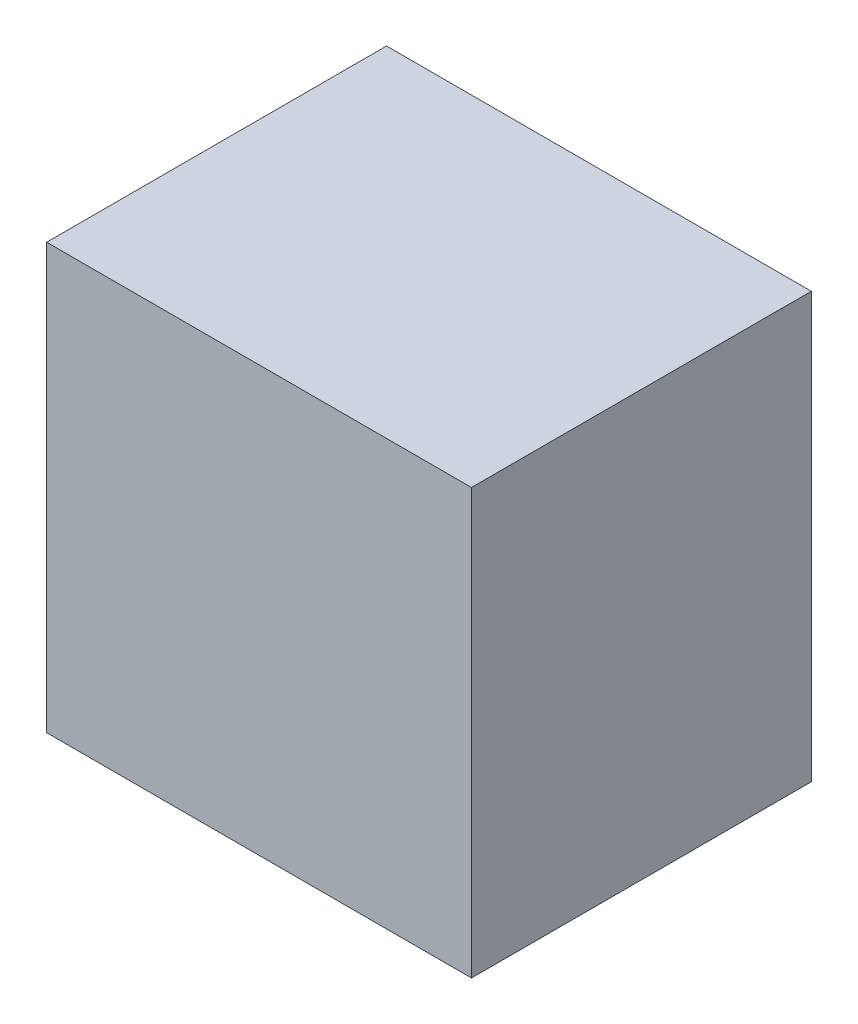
ISO-10303-21;
HEADER;
FILE_DESCRIPTION(('STEP AP214'),'2;1');
FILE_NAME('part.step','',(''),(''),'','','');
FILE_SCHEMA(('AUTOMOTIVE_DESIGN { 1 0 10303 214 1 1 1 1 }'));
ENDSEC;
DATA;
#1=APPLICATION_CONTEXT('core data for automotive mechanical design processes');
#2=APPLICATION_PROTOCOL_DEFINITION('international standard','automotive_design',2000,#1);
#3=PRODUCT_CONTEXT('',#1,'mechanical');
#4=PRODUCT('Part','Part','',(#3));
#5=PRODUCT_RELATED_PRODUCT_CATEGORY('part','',(#4));
#6=PRODUCT_DEFINITION_FORMATION('','',#4);
#7=PRODUCT_DEFINITION_CONTEXT('part definition',#1,'design');
#8=PRODUCT_DEFINITION('design','',#6,#7);
#9=PRODUCT_DEFINITION_SHAPE('','',#8);
#10=(LENGTH_UNIT() NAMED_UNIT(*) SI_UNIT(.MILLI.,.METRE.));
#11=(NAMED_UNIT(*) PLANE_ANGLE_UNIT() SI_UNIT($,.RADIAN.));
#12=(NAMED_UNIT(*) SI_UNIT($,.STERADIAN.) SOLID_ANGLE_UNIT());
#13=UNCERTAINTY_MEASURE_WITH_UNIT(LENGTH_MEASURE(1.E-05),#10,'distance_accuracy_value','');
#14=(GEOMETRIC_REPRESENTATION_CONTEXT(3) GLOBAL_UNCERTAINTY_ASSIGNED_CONTEXT((#13)) GLOBAL_UNIT_ASSIGNED_CONTEXT((#10,
#11,#12)) REPRESENTATION_CONTEXT('',''));
#15=CARTESIAN_POINT('',(0.,0.,0.));
#16=DIRECTION('',(0.,0.,1.));
#17=DIRECTION('',(1.,0.,0.));
#18=AXIS2_PLACEMENT_3D('',#15,#16,#17);
#19=CARTESIAN_POINT('',(0.,20.7846096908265,10.));
#20=DIRECTION('',(0.,0.,1.));
#21=DIRECTION('',(1.,0.,0.));
#22=AXIS2_PLACEMENT_3D('',#19,#20,#21);
#23=PLANE('',#22);
#24=DIRECTION('',(-0.866025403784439,0.5,0.));
#25=VECTOR('',#24,1.);
#26=CARTESIAN_POINT('',(8.49999999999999,4.90747728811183,10.));
#27=LINE('',#26,#25);
#28=CARTESIAN_POINT('',(8.49999999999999,4.90747728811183,10.));
#29=VERTEX_POINT('',#28);
#30=CARTESIAN_POINT('',(0.,9.81495457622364,10.));
#31=VERTEX_POINT('',#30);
#32=EDGE_CURVE('E171',#29,#31,#27,.T.);
#33=ORIENTED_EDGE('',*,*,#32,.T.);
#34=DIRECTION('',(-0.866025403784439,-0.5,0.));
#35=VECTOR('',#34,1.);
#36=CARTESIAN_POINT('',(0.,9.81495457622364,10.));
#37=LINE('',#36,#35);
#38=CARTESIAN_POINT('',(-8.5,4.90747728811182,10.));
#39=VERTEX_POINT('',#38);
#40=EDGE_CURVE('E168',#31,#39,#37,.T.);
#41=ORIENTED_EDGE('',*,*,#40,.T.);
#42=DIRECTION('',(0.,-1.,0.));
#43=VECTOR('',#42,1.);
#44=CARTESIAN_POINT('',(-8.5,4.90747728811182,10.));
#45=LINE('',#44,#43);
#46=CARTESIAN_POINT('',(-8.5,-4.90747728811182,10.));
#47=VERTEX_POINT('',#46);
#48=EDGE_CURVE('E165',#39,#47,#45,.T.);
#49=ORIENTED_EDGE('',*,*,#48,.T.);
#50=DIRECTION('',(0.866025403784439,-0.5,0.));
#51=VECTOR('',#50,1.);
#52=CARTESIAN_POINT('',(-8.5,-4.90747728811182,10.));
#53=LINE('',#52,#51);
#54=CARTESIAN_POINT('',(0.,-9.81495457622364,10.));
#55=VERTEX_POINT('',#54);
#56=EDGE_CURVE('E162',#47,#55,#53,.T.);
#57=ORIENTED_EDGE('',*,*,#56,.T.);
#58=DIRECTION('',(0.866025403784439,0.5,0.));
#59=VECTOR('',#58,1.);
#60=CARTESIAN_POINT('',(0.,-9.81495457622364,10.));
#61=LINE('',#60,#59);
#62=CARTESIAN_POINT('',(8.49999999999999,-4.90747728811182,10.));
#63=VERTEX_POINT('',#62);
#64=EDGE_CURVE('E159',#55,#63,#61,.T.);
#65=ORIENTED_EDGE('',*,*,#64,.T.);
#66=DIRECTION('',(0.,1.,0.));
#67=VECTOR('',#66,1.);
#68=CARTESIAN_POINT('',(8.49999999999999,-4.90747728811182,10.));
#69=LINE('',#68,#67);
#70=EDGE_CURVE('E156',#63,#29,#69,.T.);
#71=ORIENTED_EDGE('',*,*,#70,.T.);
#72=EDGE_LOOP('',(#33,#41,#49,#57,#65,#71));
#73=FACE_BOUND('',#72,.T.);
#74=DIRECTION('',(1.,0.,0.));
#75=VECTOR('',#74,1.);
#76=CARTESIAN_POINT('',(-25.,25.,10.));
#77=LINE('',#76,#75);
#78=CARTESIAN_POINT('',(-25.,25.,10.));
#79=VERTEX_POINT('',#78);
#80=CARTESIAN_POINT('',(25.,25.,10.));
#81=VERTEX_POINT('',#80);
#82=EDGE_CURVE('E114',#79,#81,#77,.T.);
#83=ORIENTED_EDGE('',*,*,#82,.T.);
#84=DIRECTION('',(0.,-1.,0.));
#85=VECTOR('',#84,1.);
#86=CARTESIAN_POINT('',(25.,25.,10.));
#87=LINE('',#86,#85);
#88=CARTESIAN_POINT('',(25.,-25.,10.));
#89=VERTEX_POINT('',#88);
#90=EDGE_CURVE('E51',#81,#89,#87,.T.);
#91=ORIENTED_EDGE('',*,*,#90,.T.);
#92=DIRECTION('',(-1.,0.,0.));
#93=VECTOR('',#92,1.);
#94=CARTESIAN_POINT('',(25.,-25.,10.));
#95=LINE('',#94,#93);
#96=CARTESIAN_POINT('',(-25.,-25.,10.));
#97=VERTEX_POINT('',#96);
#98=EDGE_CURVE('E115',#89,#97,#95,.T.);
#99=ORIENTED_EDGE('',*,*,#98,.T.);
#100=DIRECTION('',(0.,1.,0.));
#101=VECTOR('',#100,1.);
#102=CARTESIAN_POINT('',(-25.,-25.,10.));
#103=LINE('',#102,#101);
#104=EDGE_CURVE('E112',#97,#79,#103,.T.);
#105=ORIENTED_EDGE('',*,*,#104,.T.);
#106=EDGE_LOOP('',(#83,#91,#99,#105));
#107=FACE_BOUND('',#106,.T.);
#108=ADVANCED_FACE('F36',(#73,#107),#23,.F.);
#109=CARTESIAN_POINT('',(8.49999999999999,4.90747728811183,0.));
#110=DIRECTION('',(0.5,0.866025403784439,0.));
#111=DIRECTION('',(-0.866025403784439,0.5,0.));
#112=AXIS2_PLACEMENT_3D('',#109,#110,#111);
#113=PLANE('',#112);
#114=ORIENTED_EDGE('',*,*,#32,.F.);
#115=DIRECTION('',(0.,0.,1.));
#116=VECTOR('',#115,1.);
#117=CARTESIAN_POINT('',(8.49999999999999,4.90747728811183,0.));
#118=LINE('',#117,#116);
#119=CARTESIAN_POINT('',(8.49999999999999,4.90747728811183,0.));
#120=VERTEX_POINT('',#119);
#121=EDGE_CURVE('E143',#120,#29,#118,.T.);
#122=ORIENTED_EDGE('',*,*,#121,.F.);
#123=DIRECTION('',(-0.866025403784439,0.5,0.));
#124=VECTOR('',#123,1.);
#125=CARTESIAN_POINT('',(8.49999999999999,4.90747728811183,0.));
#126=LINE('',#125,#124);
#127=CARTESIAN_POINT('',(0.,9.81495457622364,0.));
#128=VERTEX_POINT('',#127);
#129=EDGE_CURVE('E59',#120,#128,#126,.T.);
#130=ORIENTED_EDGE('',*,*,#129,.T.);
#131=DIRECTION('',(0.,0.,1.));
#132=VECTOR('',#131,1.);
#133=CARTESIAN_POINT('',(0.,9.81495457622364,0.));
#134=LINE('',#133,#132);
#135=EDGE_CURVE('E144',#128,#31,#134,.T.);
#136=ORIENTED_EDGE('',*,*,#135,.T.);
#137=EDGE_LOOP('',(#114,#122,#130,#136));
#138=FACE_BOUND('',#137,.T.);
#139=ADVANCED_FACE('F213',(#138),#113,.T.);
#140=CARTESIAN_POINT('',(8.49999999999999,-4.90747728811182,0.));
#141=DIRECTION('',(1.,0.,0.));
#142=DIRECTION('',(0.,1.,0.));
#143=AXIS2_PLACEMENT_3D('',#140,#141,#142);
#144=PLANE('',#143);
#145=ORIENTED_EDGE('',*,*,#70,.F.);
#146=DIRECTION('',(0.,0.,1.));
#147=VECTOR('',#146,1.);
#148=CARTESIAN_POINT('',(8.49999999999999,-4.90747728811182,0.));
#149=LINE('',#148,#147);
#150=CARTESIAN_POINT('',(8.49999999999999,-4.90747728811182,0.));
#151=VERTEX_POINT('',#150);
#152=EDGE_CURVE('E153',#151,#63,#149,.T.);
#153=ORIENTED_EDGE('',*,*,#152,.F.);
#154=DIRECTION('',(0.,1.,0.));
#155=VECTOR('',#154,1.);
#156=CARTESIAN_POINT('',(8.49999999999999,-4.90747728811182,0.));
#157=LINE('',#156,#155);
#158=EDGE_CURVE('E147',#151,#120,#157,.T.);
#159=ORIENTED_EDGE('',*,*,#158,.T.);
#160=ORIENTED_EDGE('',*,*,#121,.T.);
#161=EDGE_LOOP('',(#145,#153,#159,#160));
#162=FACE_BOUND('',#161,.T.);
#163=ADVANCED_FACE('F212',(#162),#144,.T.);
#164=CARTESIAN_POINT('',(0.,-9.81495457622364,0.));
#165=DIRECTION('',(0.5,-0.866025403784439,0.));
#166=DIRECTION('',(0.866025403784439,0.5,0.));
#167=AXIS2_PLACEMENT_3D('',#164,#165,#166);
#168=PLANE('',#167);
#169=ORIENTED_EDGE('',*,*,#64,.F.);
#170=DIRECTION('',(0.,0.,1.));
#171=VECTOR('',#170,1.);
#172=CARTESIAN_POINT('',(0.,-9.81495457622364,0.));
#173=LINE('',#172,#171);
#174=CARTESIAN_POINT('',(0.,-9.81495457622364,0.));
#175=VERTEX_POINT('',#174);
#176=EDGE_CURVE('E151',#175,#55,#173,.T.);
#177=ORIENTED_EDGE('',*,*,#176,.F.);
#178=DIRECTION('',(0.866025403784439,0.5,0.));
#179=VECTOR('',#178,1.);
#180=CARTESIAN_POINT('',(0.,-9.81495457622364,0.));
#181=LINE('',#180,#179);
#182=EDGE_CURVE('E175',#175,#151,#181,.T.);
#183=ORIENTED_EDGE('',*,*,#182,.T.);
#184=ORIENTED_EDGE('',*,*,#152,.T.);
#185=EDGE_LOOP('',(#169,#177,#183,#184));
#186=FACE_BOUND('',#185,.T.);
#187=ADVANCED_FACE('F207',(#186),#168,.T.);
#188=CARTESIAN_POINT('',(-8.5,-4.90747728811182,0.));
#189=DIRECTION('',(-0.5,-0.866025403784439,0.));
#190=DIRECTION('',(0.866025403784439,-0.5,0.));
#191=AXIS2_PLACEMENT_3D('',#188,#189,#190);
#192=PLANE('',#191);
#193=ORIENTED_EDGE('',*,*,#56,.F.);
#194=DIRECTION('',(0.,0.,1.));
#195=VECTOR('',#194,1.);
#196=CARTESIAN_POINT('',(-8.5,-4.90747728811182,0.));
#197=LINE('',#196,#195);
#198=CARTESIAN_POINT('',(-8.5,-4.90747728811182,0.));
#199=VERTEX_POINT('',#198);
#200=EDGE_CURVE('E149',#199,#47,#197,.T.);
#201=ORIENTED_EDGE('',*,*,#200,.F.);
#202=DIRECTION('',(0.866025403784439,-0.5,0.));
#203=VECTOR('',#202,1.);
#204=CARTESIAN_POINT('',(-8.5,-4.90747728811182,0.));
#205=LINE('',#204,#203);
#206=EDGE_CURVE('E178',#199,#175,#205,.T.);
#207=ORIENTED_EDGE('',*,*,#206,.T.);
#208=ORIENTED_EDGE('',*,*,#176,.T.);
#209=EDGE_LOOP('',(#193,#201,#207,#208));
#210=FACE_BOUND('',#209,.T.);
#211=ADVANCED_FACE('F205',(#210),#192,.T.);
#212=CARTESIAN_POINT('',(-8.5,4.90747728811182,0.));
#213=DIRECTION('',(-1.,0.,0.));
#214=DIRECTION('',(0.,-1.,0.));
#215=AXIS2_PLACEMENT_3D('',#212,#213,#214);
#216=PLANE('',#215);
#217=ORIENTED_EDGE('',*,*,#48,.F.);
#218=DIRECTION('',(0.,0.,1.));
#219=VECTOR('',#218,1.);
#220=CARTESIAN_POINT('',(-8.5,4.90747728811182,0.));
#221=LINE('',#220,#219);
#222=CARTESIAN_POINT('',(-8.5,4.90747728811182,0.));
#223=VERTEX_POINT('',#222);
#224=EDGE_CURVE('E146',#223,#39,#221,.T.);
#225=ORIENTED_EDGE('',*,*,#224,.F.);
#226=DIRECTION('',(0.,-1.,0.));
#227=VECTOR('',#226,1.);
#228=CARTESIAN_POINT('',(-8.5,4.90747728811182,0.));
#229=LINE('',#228,#227);
#230=EDGE_CURVE('E181',#223,#199,#229,.T.);
#231=ORIENTED_EDGE('',*,*,#230,.T.);
#232=ORIENTED_EDGE('',*,*,#200,.T.);
#233=EDGE_LOOP('',(#217,#225,#231,#232));
#234=FACE_BOUND('',#233,.T.);
#235=ADVANCED_FACE('F200',(#234),#216,.T.);
#236=CARTESIAN_POINT('',(0.,9.81495457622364,0.));
#237=DIRECTION('',(-0.5,0.866025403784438,0.));
#238=DIRECTION('',(-0.866025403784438,-0.5,0.));
#239=AXIS2_PLACEMENT_3D('',#236,#237,#238);
#240=PLANE('',#239);
#241=ORIENTED_EDGE('',*,*,#40,.F.);
#242=ORIENTED_EDGE('',*,*,#135,.F.);
#243=DIRECTION('',(-0.866025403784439,-0.5,0.));
#244=VECTOR('',#243,1.);
#245=CARTESIAN_POINT('',(0.,9.81495457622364,0.));
#246=LINE('',#245,#244);
#247=EDGE_CURVE('E184',#128,#223,#246,.T.);
#248=ORIENTED_EDGE('',*,*,#247,.T.);
#249=ORIENTED_EDGE('',*,*,#224,.T.);
#250=EDGE_LOOP('',(#241,#242,#248,#249));
#251=FACE_BOUND('',#250,.T.);
#252=ADVANCED_FACE('F193',(#251),#240,.T.);
#253=CARTESIAN_POINT('',(25.,25.,0.));
#254=DIRECTION('',(0.,0.,-1.));
#255=DIRECTION('',(-1.,0.,0.));
#256=AXIS2_PLACEMENT_3D('',#253,#254,#255);
#257=PLANE('',#256);
#258=ORIENTED_EDGE('',*,*,#247,.F.);
#259=ORIENTED_EDGE('',*,*,#129,.F.);
#260=ORIENTED_EDGE('',*,*,#158,.F.);
#261=ORIENTED_EDGE('',*,*,#182,.F.);
#262=ORIENTED_EDGE('',*,*,#206,.F.);
#263=ORIENTED_EDGE('',*,*,#230,.F.);
#264=EDGE_LOOP('',(#258,#259,#260,#261,#262,#263));
#265=FACE_BOUND('',#264,.T.);
#266=ADVANCED_FACE('F196',(#265),#257,.T.);
#267=CARTESIAN_POINT('',(25.,25.,50.));
#268=DIRECTION('',(0.,0.,-1.));
#269=DIRECTION('',(-1.,0.,0.));
#270=AXIS2_PLACEMENT_3D('',#267,#268,#269);
#271=PLANE('',#270);
#272=DIRECTION('',(0.,1.,0.));
#273=VECTOR('',#272,1.);
#274=CARTESIAN_POINT('',(25.,-25.,50.));
#275=LINE('',#274,#273);
#276=CARTESIAN_POINT('',(25.,-25.,50.));
#277=VERTEX_POINT('',#276);
#278=CARTESIAN_POINT('',(25.,25.,50.));
#279=VERTEX_POINT('',#278);
#280=EDGE_CURVE('E140',#277,#279,#275,.T.);
#281=ORIENTED_EDGE('',*,*,#280,.T.);
#282=DIRECTION('',(-1.,0.,0.));
#283=VECTOR('',#282,1.);
#284=CARTESIAN_POINT('',(-25.,25.,50.));
#285=LINE('',#284,#283);
#286=CARTESIAN_POINT('',(-25.,25.,50.));
#287=VERTEX_POINT('',#286);
#288=EDGE_CURVE('E138',#279,#287,#285,.T.);
#289=ORIENTED_EDGE('',*,*,#288,.T.);
#290=DIRECTION('',(0.,-1.,0.));
#291=VECTOR('',#290,1.);
#292=CARTESIAN_POINT('',(-25.,-25.,50.));
#293=LINE('',#292,#291);
#294=CARTESIAN_POINT('',(-25.,-25.,50.));
#295=VERTEX_POINT('',#294);
#296=EDGE_CURVE('E128',#287,#295,#293,.T.);
#297=ORIENTED_EDGE('',*,*,#296,.T.);
#298=DIRECTION('',(1.,0.,0.));
#299=VECTOR('',#298,1.);
#300=CARTESIAN_POINT('',(-25.,-25.,50.));
#301=LINE('',#300,#299);
#302=EDGE_CURVE('E135',#295,#277,#301,.T.);
#303=ORIENTED_EDGE('',*,*,#302,.T.);
#304=EDGE_LOOP('',(#281,#289,#297,#303));
#305=FACE_BOUND('',#304,.T.);
#306=ADVANCED_FACE('F225',(#305),#271,.F.);
#307=CARTESIAN_POINT('',(-25.,-25.,50.));
#308=DIRECTION('',(0.,1.,0.));
#309=DIRECTION('',(0.,0.,1.));
#310=AXIS2_PLACEMENT_3D('',#307,#308,#309);
#311=PLANE('',#310);
#312=DIRECTION('',(0.,0.,-1.));
#313=VECTOR('',#312,1.);
#314=CARTESIAN_POINT('',(-25.,-25.,50.));
#315=LINE('',#314,#313);
#316=EDGE_CURVE('E129',#295,#97,#315,.T.);
#317=ORIENTED_EDGE('',*,*,#316,.T.);
#318=ORIENTED_EDGE('',*,*,#98,.F.);
#319=DIRECTION('',(0.,0.,-1.));
#320=VECTOR('',#319,1.);
#321=CARTESIAN_POINT('',(25.,-25.,50.));
#322=LINE('',#321,#320);
#323=EDGE_CURVE('E130',#277,#89,#322,.T.);
#324=ORIENTED_EDGE('',*,*,#323,.F.);
#325=ORIENTED_EDGE('',*,*,#302,.F.);
#326=EDGE_LOOP('',(#317,#318,#324,#325));
#327=FACE_BOUND('',#326,.T.);
#328=ADVANCED_FACE('F228',(#327),#311,.F.);
#329=CARTESIAN_POINT('',(-25.,-25.,50.));
#330=DIRECTION('',(1.,0.,0.));
#331=DIRECTION('',(0.,0.,-1.));
#332=AXIS2_PLACEMENT_3D('',#329,#330,#331);
#333=PLANE('',#332);
#334=DIRECTION('',(0.,0.,-1.));
#335=VECTOR('',#334,1.);
#336=CARTESIAN_POINT('',(-25.,25.,50.));
#337=LINE('',#336,#335);
#338=EDGE_CURVE('E44',#287,#79,#337,.T.);
#339=ORIENTED_EDGE('',*,*,#338,.T.);
#340=ORIENTED_EDGE('',*,*,#104,.F.);
#341=ORIENTED_EDGE('',*,*,#316,.F.);
#342=ORIENTED_EDGE('',*,*,#296,.F.);
#343=EDGE_LOOP('',(#339,#340,#341,#342));
#344=FACE_BOUND('',#343,.T.);
#345=ADVANCED_FACE('F127',(#344),#333,.F.);
#346=CARTESIAN_POINT('',(-25.,25.,50.));
#347=DIRECTION('',(0.,-1.,0.));
#348=DIRECTION('',(0.,0.,-1.));
#349=AXIS2_PLACEMENT_3D('',#346,#347,#348);
#350=PLANE('',#349);
#351=DIRECTION('',(0.,0.,-1.));
#352=VECTOR('',#351,1.);
#353=CARTESIAN_POINT('',(25.,25.,50.));
#354=LINE('',#353,#352);
#355=EDGE_CURVE('E11',#279,#81,#354,.T.);
#356=ORIENTED_EDGE('',*,*,#355,.T.);
#357=ORIENTED_EDGE('',*,*,#82,.F.);
#358=ORIENTED_EDGE('',*,*,#338,.F.);
#359=ORIENTED_EDGE('',*,*,#288,.F.);
#360=EDGE_LOOP('',(#356,#357,#358,#359));
#361=FACE_BOUND('',#360,.T.);
#362=ADVANCED_FACE('F123',(#361),#350,.F.);
#363=CARTESIAN_POINT('',(25.,-25.,50.));
#364=DIRECTION('',(-1.,0.,0.));
#365=DIRECTION('',(0.,0.,1.));
#366=AXIS2_PLACEMENT_3D('',#363,#364,#365);
#367=PLANE('',#366);
#368=ORIENTED_EDGE('',*,*,#323,.T.);
#369=ORIENTED_EDGE('',*,*,#90,.F.);
#370=ORIENTED_EDGE('',*,*,#355,.F.);
#371=ORIENTED_EDGE('',*,*,#280,.F.);
#372=EDGE_LOOP('',(#368,#369,#370,#371));
#373=FACE_BOUND('',#372,.T.);
#374=ADVANCED_FACE('F38',(#373),#367,.F.);
#375=CLOSED_SHELL('',(#108,#139,#163,#187,#211,#235,#252,#266,#306,#328,#345,#362,#374));
#376=MANIFOLD_SOLID_BREP('B2',#375);
#377=ADVANCED_BREP_SHAPE_REPRESENTATION('',(#18,#376),#14);
#378=SHAPE_DEFINITION_REPRESENTATION(#9,#377);
ENDSEC;
END-ISO-10303-21;
